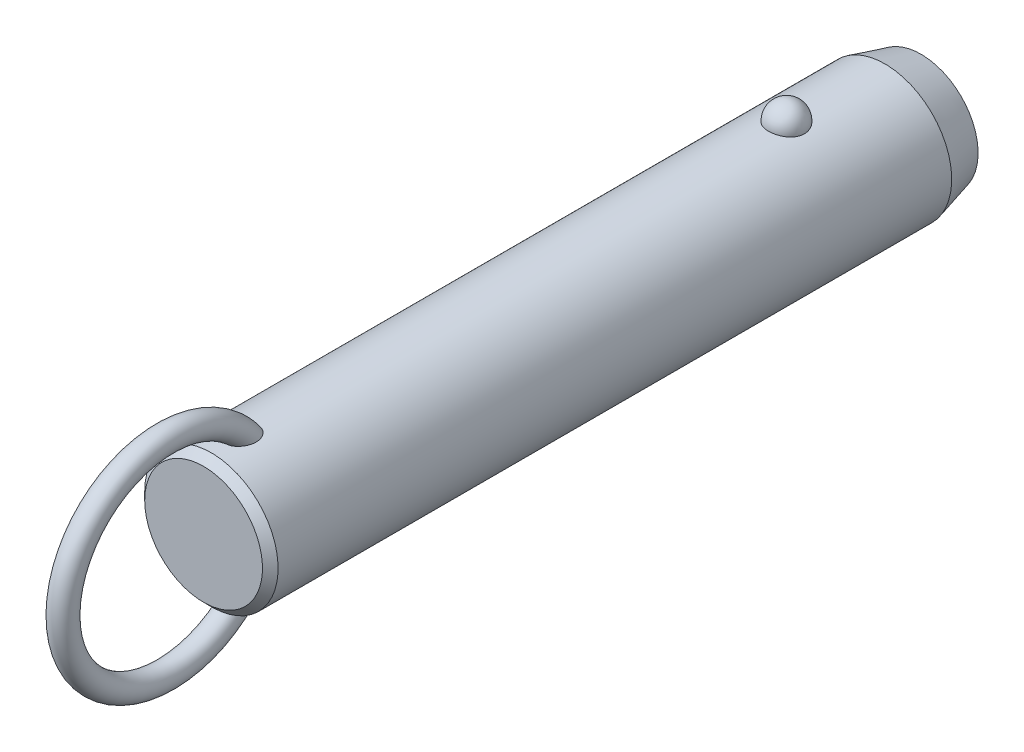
ISO-10303-21;
HEADER;
FILE_DESCRIPTION(('STEP AP214'),'2;1');
FILE_NAME('part.step','',(''),(''),'','','');
FILE_SCHEMA(('AUTOMOTIVE_DESIGN { 1 0 10303 214 1 1 1 1 }'));
ENDSEC;
DATA;
#1=APPLICATION_CONTEXT('core data for automotive mechanical design processes');
#2=APPLICATION_PROTOCOL_DEFINITION('international standard','automotive_design',2000,#1);
#3=PRODUCT_CONTEXT('',#1,'mechanical');
#4=PRODUCT('Part','Part','',(#3));
#5=PRODUCT_RELATED_PRODUCT_CATEGORY('part','',(#4));
#6=PRODUCT_DEFINITION_FORMATION('','',#4);
#7=PRODUCT_DEFINITION_CONTEXT('part definition',#1,'design');
#8=PRODUCT_DEFINITION('design','',#6,#7);
#9=PRODUCT_DEFINITION_SHAPE('','',#8);
#10=(LENGTH_UNIT() NAMED_UNIT(*) SI_UNIT(.MILLI.,.METRE.));
#11=(NAMED_UNIT(*) PLANE_ANGLE_UNIT() SI_UNIT($,.RADIAN.));
#12=(NAMED_UNIT(*) SI_UNIT($,.STERADIAN.) SOLID_ANGLE_UNIT());
#13=UNCERTAINTY_MEASURE_WITH_UNIT(LENGTH_MEASURE(1.E-05),#10,'distance_accuracy_value','');
#14=(GEOMETRIC_REPRESENTATION_CONTEXT(3) GLOBAL_UNCERTAINTY_ASSIGNED_CONTEXT((#13)) GLOBAL_UNIT_ASSIGNED_CONTEXT((#10,
#11,#12)) REPRESENTATION_CONTEXT('',''));
#15=CARTESIAN_POINT('',(0.,0.,0.));
#16=DIRECTION('',(0.,0.,1.));
#17=DIRECTION('',(1.,0.,0.));
#18=AXIS2_PLACEMENT_3D('',#15,#16,#17);
#19=CARTESIAN_POINT('',(0.,0.,81.3));
#20=DIRECTION('',(0.,0.,-1.));
#21=DIRECTION('',(-1.,0.,0.));
#22=AXIS2_PLACEMENT_3D('',#19,#20,#21);
#23=CYLINDRICAL_SURFACE('',#22,11.1);
#24=CARTESIAN_POINT('',(2.9724815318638,10.6945945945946,-3.));
#25=CARTESIAN_POINT('',(2.97247830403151,10.6945972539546,-2.83225059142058));
#26=CARTESIAN_POINT('',(2.95876598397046,10.6984356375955,-2.66445972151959));
#27=CARTESIAN_POINT('',(2.90424529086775,10.7133624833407,-2.33362381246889));
#28=CARTESIAN_POINT('',(2.8634252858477,10.7244540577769,-2.1705808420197));
#29=CARTESIAN_POINT('',(2.75573657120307,10.7526272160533,-1.85396767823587));
#30=CARTESIAN_POINT('',(2.68887937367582,10.7697061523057,-1.70039333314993));
#31=CARTESIAN_POINT('',(2.53079696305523,10.8079438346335,-1.40691598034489));
#32=CARTESIAN_POINT('',(2.43957264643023,10.8291024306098,-1.2670124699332));
#33=CARTESIAN_POINT('',(2.23458150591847,10.8732541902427,-1.00409565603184));
#34=CARTESIAN_POINT('',(2.12071295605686,10.8962553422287,-0.881162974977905));
#35=CARTESIAN_POINT('',(1.87365402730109,10.9414421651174,-0.656352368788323));
#36=CARTESIAN_POINT('',(1.74046358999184,10.9636278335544,-0.554474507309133));
#37=CARTESIAN_POINT('',(1.45872188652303,11.0046495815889,-0.374872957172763));
#38=CARTESIAN_POINT('',(1.31021276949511,11.0234944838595,-0.297085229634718));
#39=CARTESIAN_POINT('',(1.00170030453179,11.0557957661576,-0.167529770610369));
#40=CARTESIAN_POINT('',(0.841698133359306,11.0692526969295,-0.115759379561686));
#41=CARTESIAN_POINT('',(0.517607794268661,11.0890932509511,-0.0403925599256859));
#42=CARTESIAN_POINT('',(0.353633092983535,11.0955916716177,-0.0163383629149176));
#43=CARTESIAN_POINT('',(0.0238420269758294,11.1011989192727,0.0044517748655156));
#44=CARTESIAN_POINT('',(-0.141974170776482,11.1003084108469,0.00119017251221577));
#45=CARTESIAN_POINT('',(-0.468405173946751,11.0912990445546,-0.0323233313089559));
#46=CARTESIAN_POINT('',(-0.629059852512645,11.0832767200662,-0.0622147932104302));
#47=CARTESIAN_POINT('',(-0.942937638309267,11.0609962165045,-0.147645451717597));
#48=CARTESIAN_POINT('',(-1.09616062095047,11.0467379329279,-0.203185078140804));
#49=CARTESIAN_POINT('',(-1.39181061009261,11.0134071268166,-0.3387529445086));
#50=CARTESIAN_POINT('',(-1.53417383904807,10.9943086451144,-0.418913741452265));
#51=CARTESIAN_POINT('',(-1.80342160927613,10.9533667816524,-0.60144882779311));
#52=CARTESIAN_POINT('',(-1.9303046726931,10.9315231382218,-0.703825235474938));
#53=CARTESIAN_POINT('',(-2.16747598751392,10.887005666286,-0.930091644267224));
#54=CARTESIAN_POINT('',(-2.27742774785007,10.8643239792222,-1.05433291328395));
#55=CARTESIAN_POINT('',(-2.47517316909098,10.8209886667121,-1.31966633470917));
#56=CARTESIAN_POINT('',(-2.56296538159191,10.8003351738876,-1.46075958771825));
#57=CARTESIAN_POINT('',(-2.71500300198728,10.7631304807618,-1.75753646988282));
#58=CARTESIAN_POINT('',(-2.77898901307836,10.7466250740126,-1.91335887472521));
#59=CARTESIAN_POINT('',(-2.88046189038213,10.7198747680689,-2.2339152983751));
#60=CARTESIAN_POINT('',(-2.91794947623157,10.709629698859,-2.39864907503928));
#61=CARTESIAN_POINT('',(-2.96537819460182,10.6965949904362,-2.73165170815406));
#62=CARTESIAN_POINT('',(-2.97542891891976,10.693775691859,-2.89990378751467));
#63=CARTESIAN_POINT('',(-2.96804271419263,10.6958279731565,-3.235752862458));
#64=CARTESIAN_POINT('',(-2.95060646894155,10.7006993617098,-3.40334987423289));
#65=CARTESIAN_POINT('',(-2.88883358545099,10.71753912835,-3.73233906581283));
#66=CARTESIAN_POINT('',(-2.84462026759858,10.7294749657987,-3.89375610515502));
#67=CARTESIAN_POINT('',(-2.73050447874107,10.7590797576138,-4.20667949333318));
#68=CARTESIAN_POINT('',(-2.66060103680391,10.7767489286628,-4.35818546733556));
#69=CARTESIAN_POINT('',(-2.49642559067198,10.8159599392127,-4.6478542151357));
#70=CARTESIAN_POINT('',(-2.40203047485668,10.8375211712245,-4.78594458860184));
#71=CARTESIAN_POINT('',(-2.19143488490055,10.8820570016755,-5.0441038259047));
#72=CARTESIAN_POINT('',(-2.07523364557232,10.9050316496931,-5.16417205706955));
#73=CARTESIAN_POINT('',(-1.82361254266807,10.9499219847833,-5.38334833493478));
#74=CARTESIAN_POINT('',(-1.68812945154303,10.9718338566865,-5.48238464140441));
#75=CARTESIAN_POINT('',(-1.40191298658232,11.0120611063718,-5.65618873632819));
#76=CARTESIAN_POINT('',(-1.25118062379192,11.0303767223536,-5.73095813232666));
#77=CARTESIAN_POINT('',(-0.940570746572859,11.0611653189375,-5.85334725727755));
#78=CARTESIAN_POINT('',(-0.780821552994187,11.0737044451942,-5.90127578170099));
#79=CARTESIAN_POINT('',(-0.455204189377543,11.0918598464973,-5.96992976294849));
#80=CARTESIAN_POINT('',(-0.289336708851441,11.0974768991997,-5.99065827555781));
#81=CARTESIAN_POINT('',(0.0406846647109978,11.1011307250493,-6.00418773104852));
#82=CARTESIAN_POINT('',(0.204817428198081,11.099299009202,-5.99747318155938));
#83=CARTESIAN_POINT('',(0.5295530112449,11.088551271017,-5.9574031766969));
#84=CARTESIAN_POINT('',(0.69015594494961,11.0796354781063,-5.92404858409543));
#85=CARTESIAN_POINT('',(1.0027760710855,11.0557204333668,-5.83180084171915));
#86=CARTESIAN_POINT('',(1.15482001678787,11.0407414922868,-5.77299291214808));
#87=CARTESIAN_POINT('',(1.44678373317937,11.0062913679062,-5.63147366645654));
#88=CARTESIAN_POINT('',(1.58670279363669,10.9868199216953,-5.54876095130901));
#89=CARTESIAN_POINT('',(1.8527023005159,10.9451315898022,-5.36027644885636));
#90=CARTESIAN_POINT('',(1.97855158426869,10.9228788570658,-5.25418644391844));
#91=CARTESIAN_POINT('',(2.21080872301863,10.8782509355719,-5.02251354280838));
#92=CARTESIAN_POINT('',(2.31721312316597,10.8558757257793,-4.89692718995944));
#93=CARTESIAN_POINT('',(2.5094551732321,10.8130715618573,-4.62745408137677));
#94=CARTESIAN_POINT('',(2.59493284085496,10.7926798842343,-4.48330448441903));
#95=CARTESIAN_POINT('',(2.740862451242,10.7565495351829,-4.18236358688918));
#96=CARTESIAN_POINT('',(2.80132490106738,10.7408089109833,-4.02557762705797));
#97=CARTESIAN_POINT('',(2.88959070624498,10.7173718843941,-3.72475308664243));
#98=CARTESIAN_POINT('',(2.92062102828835,10.7088950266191,-3.58171216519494));
#99=CARTESIAN_POINT('',(2.96206765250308,10.6975052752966,-3.29245795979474));
#100=CARTESIAN_POINT('',(2.97248434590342,10.6945922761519,-3.14624473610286));
#101=CARTESIAN_POINT('',(2.9724815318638,10.6945945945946,-3.));
#102=B_SPLINE_CURVE_WITH_KNOTS('',3,(#24,#25,#26,#27,#28,#29,#30,#31,#32,#33,#34,#35,#36,#37,
#38,#39,#40,#41,#42,#43,#44,#45,#46,#47,#48,#49,#50,#51,#52,#53,#54,#55,#56,#57,#58,#59,#60,#61,
#62,#63,#64,#65,#66,#67,#68,#69,#70,#71,#72,#73,#74,#75,#76,#77,#78,#79,#80,#81,#82,#83,#84,#85,
#86,#87,#88,#89,#90,#91,#92,#93,#94,#95,#96,#97,#98,#99,#100,#101),.UNSPECIFIED.,.T.,.F.,(4,2,2,
2,2,2,2,2,2,2,2,2,2,2,2,2,2,2,2,2,2,2,2,2,2,2,2,2,2,2,2,2,2,2,2,2,2,2,4),(0.,0.502722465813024,
1.00566079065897,1.5083769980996,2.01107471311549,2.51608392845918,3.02109467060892,
3.52475118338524,4.02835620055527,4.523518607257,5.0186364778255,5.50715297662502,
5.9956776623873,6.48688002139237,6.97812923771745,7.47814366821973,7.9781907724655,
8.48353712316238,8.9888697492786,9.49218093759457,9.99547960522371,10.4964777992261,
10.997494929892,11.5010810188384,12.0046847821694,12.5099796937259,13.0152411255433,
13.5145635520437,14.0138298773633,14.5043200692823,14.9947943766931,15.4836390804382,
15.9725123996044,16.4685040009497,16.9645836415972,17.4686765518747,17.972557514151,
18.410841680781,18.849117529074),.UNSPECIFIED.);
#103=CARTESIAN_POINT('',(2.9724815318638,10.6945945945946,-3.));
#104=VERTEX_POINT('',#103);
#105=EDGE_CURVE('E41',#104,#104,#102,.T.);
#106=ORIENTED_EDGE('',*,*,#105,.T.);
#107=EDGE_LOOP('',(#106));
#108=FACE_BOUND('',#107,.T.);
#109=CARTESIAN_POINT('',(0.,0.,92.7));
#110=DIRECTION('',(0.,0.,1.));
#111=DIRECTION('',(1.,0.,0.));
#112=AXIS2_PLACEMENT_3D('',#109,#110,#111);
#113=CIRCLE('',#112,11.1);
#114=CARTESIAN_POINT('',(-11.1,0.,92.7));
#115=VERTEX_POINT('',#114);
#116=EDGE_CURVE('E10',#115,#115,#113,.F.);
#117=ORIENTED_EDGE('',*,*,#116,.T.);
#118=EDGE_LOOP('',(#117));
#119=FACE_BOUND('',#118,.T.);
#120=CARTESIAN_POINT('',(-0.564520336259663,-11.0856356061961,84.9578154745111));
#121=CARTESIAN_POINT('',(-0.667202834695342,-11.0804062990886,84.9912839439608));
#122=CARTESIAN_POINT('',(-0.766875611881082,-11.0738877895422,85.0338357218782));
#123=CARTESIAN_POINT('',(-0.957284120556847,-11.0590576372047,85.1354190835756));
#124=CARTESIAN_POINT('',(-1.04801616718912,-11.0507452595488,85.1944574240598));
#125=CARTESIAN_POINT('',(-1.21800952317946,-11.0333016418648,85.3265293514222));
#126=CARTESIAN_POINT('',(-1.29730805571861,-11.0241732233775,85.3995156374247));
#127=CARTESIAN_POINT('',(-1.44337665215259,-11.0060026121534,85.5570374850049));
#128=CARTESIAN_POINT('',(-1.51014622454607,-10.9969604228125,85.6415734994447));
#129=CARTESIAN_POINT('',(-1.63454620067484,-10.9791841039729,85.8255213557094));
#130=CARTESIAN_POINT('',(-1.69127003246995,-10.9705107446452,85.9255493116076));
#131=CARTESIAN_POINT('',(-1.78980785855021,-10.9548648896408,86.1327902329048));
#132=CARTESIAN_POINT('',(-1.83161214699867,-10.9478935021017,86.2400078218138));
#133=CARTESIAN_POINT('',(-1.91557028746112,-10.9335803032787,86.5054080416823));
#134=CARTESIAN_POINT('',(-1.95040620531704,-10.9273269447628,86.6659806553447));
#135=CARTESIAN_POINT('',(-1.99388326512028,-10.9194709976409,86.9906977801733));
#136=CARTESIAN_POINT('',(-2.00248051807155,-10.9178762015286,87.1548478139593));
#137=CARTESIAN_POINT('',(-1.99551615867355,-10.9191578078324,87.5246504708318));
#138=CARTESIAN_POINT('',(-1.9732206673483,-10.9232807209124,87.7301911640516));
#139=CARTESIAN_POINT('',(-1.91529761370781,-10.9335244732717,88.0335954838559));
#140=CARTESIAN_POINT('',(-1.8918457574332,-10.9376266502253,88.1340883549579));
#141=CARTESIAN_POINT('',(-1.83700674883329,-10.9469720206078,88.332855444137));
#142=CARTESIAN_POINT('',(-1.80562070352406,-10.9522150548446,88.4311299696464));
#143=CARTESIAN_POINT('',(-1.73463055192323,-10.9636837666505,88.6259148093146));
#144=CARTESIAN_POINT('',(-1.69493416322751,-10.9699202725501,88.7223907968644));
#145=CARTESIAN_POINT('',(-1.6074514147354,-10.9830806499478,88.9116262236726));
#146=CARTESIAN_POINT('',(-1.55966150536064,-10.9900048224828,89.0043840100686));
#147=CARTESIAN_POINT('',(-1.45591812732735,-11.0042280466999,89.1846907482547));
#148=CARTESIAN_POINT('',(-1.40000013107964,-11.0115253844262,89.2722601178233));
#149=CARTESIAN_POINT('',(-1.27937470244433,-11.0261911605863,89.4410298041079));
#150=CARTESIAN_POINT('',(-1.21467835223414,-11.0335594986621,89.5222379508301));
#151=CARTESIAN_POINT('',(-1.08218150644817,-11.0473027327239,89.6690010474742));
#152=CARTESIAN_POINT('',(-1.01522633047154,-11.0537063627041,89.735309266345));
#153=CARTESIAN_POINT('',(-0.872952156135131,-11.065850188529,89.8583780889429));
#154=CARTESIAN_POINT('',(-0.797642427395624,-11.0715911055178,89.9151491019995));
#155=CARTESIAN_POINT('',(-0.651396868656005,-11.081071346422,90.0075155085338));
#156=CARTESIAN_POINT('',(-0.581712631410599,-11.0849841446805,90.0450491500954));
#157=CARTESIAN_POINT('',(-0.437066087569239,-11.0916271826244,90.1082594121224));
#158=CARTESIAN_POINT('',(-0.362109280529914,-11.0943586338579,90.1339481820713));
#159=CARTESIAN_POINT('',(-0.207828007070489,-11.0983242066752,90.171117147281));
#160=CARTESIAN_POINT('',(-0.128467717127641,-11.0995432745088,90.1824545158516));
#161=CARTESIAN_POINT('',(0.0309101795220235,-11.1002423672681,90.1889658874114));
#162=CARTESIAN_POINT('',(0.110927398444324,-11.0997233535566,90.1841488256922));
#163=CARTESIAN_POINT('',(0.256406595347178,-11.097240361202,90.1609599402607));
#164=CARTESIAN_POINT('',(0.32223577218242,-11.0955074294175,90.1447543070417));
#165=CARTESIAN_POINT('',(0.450635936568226,-11.0910350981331,90.1026008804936));
#166=CARTESIAN_POINT('',(0.513205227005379,-11.0882951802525,90.0766480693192));
#167=CARTESIAN_POINT('',(0.662626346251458,-11.0805620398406,90.0026073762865));
#168=CARTESIAN_POINT('',(0.747127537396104,-11.0751144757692,89.9498452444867));
#169=CARTESIAN_POINT('',(0.906756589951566,-11.0631932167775,89.8317206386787));
#170=CARTESIAN_POINT('',(0.981859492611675,-11.0567168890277,89.7663257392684));
#171=CARTESIAN_POINT('',(1.10712207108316,-11.0447856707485,89.6422633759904));
#172=CARTESIAN_POINT('',(1.15909566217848,-11.0394280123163,89.5853831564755));
#173=CARTESIAN_POINT('',(1.25791923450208,-11.0286040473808,89.4673271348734));
#174=CARTESIAN_POINT('',(1.30476642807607,-11.0231376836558,89.4061490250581));
#175=CARTESIAN_POINT('',(1.43818612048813,-11.0068027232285,89.217305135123));
#176=CARTESIAN_POINT('',(1.51751767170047,-10.9960104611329,89.0844531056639));
#177=CARTESIAN_POINT('',(1.63597546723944,-10.9788847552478,88.8531371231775));
#178=CARTESIAN_POINT('',(1.67988876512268,-10.9722190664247,88.7570530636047));
#179=CARTESIAN_POINT('',(1.75953241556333,-10.9597298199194,88.5614311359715));
#180=CARTESIAN_POINT('',(1.79525967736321,-10.9539065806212,88.4618919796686));
#181=CARTESIAN_POINT('',(1.85844731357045,-10.9433632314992,88.2602111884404));
#182=CARTESIAN_POINT('',(1.88591073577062,-10.9386427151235,88.1580705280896));
#183=CARTESIAN_POINT('',(1.93234324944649,-10.9305350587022,87.9518191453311));
#184=CARTESIAN_POINT('',(1.95131065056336,-10.9271481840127,87.8477080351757));
#185=CARTESIAN_POINT('',(1.99040203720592,-10.9201183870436,87.5654588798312));
#186=CARTESIAN_POINT('',(2.00221217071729,-10.9179256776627,87.3860370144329));
#187=CARTESIAN_POINT('',(1.99711676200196,-10.9188636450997,87.0277133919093));
#188=CARTESIAN_POINT('',(1.98026150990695,-10.9219849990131,86.848811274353));
#189=CARTESIAN_POINT('',(1.92151657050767,-10.9324473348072,86.5364514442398));
#190=CARTESIAN_POINT('',(1.88605081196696,-10.9386915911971,86.4017594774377));
#191=CARTESIAN_POINT('',(1.7939302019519,-10.9541780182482,86.1399669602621));
#192=CARTESIAN_POINT('',(1.73729868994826,-10.9634168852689,86.0128582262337));
#193=CARTESIAN_POINT('',(1.612370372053,-10.9824218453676,85.7894184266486));
#194=CARTESIAN_POINT('',(1.54715374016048,-10.9918945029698,85.6913455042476));
#195=CARTESIAN_POINT('',(1.40127026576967,-11.0114415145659,85.5074341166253));
#196=CARTESIAN_POINT('',(1.32060742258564,-11.0215157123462,85.4215924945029));
#197=CARTESIAN_POINT('',(1.14474787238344,-11.041168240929,85.2651630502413));
#198=CARTESIAN_POINT('',(1.04947805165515,-11.0507437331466,85.1946565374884));
#199=CARTESIAN_POINT('',(0.847278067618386,-11.0680789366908,85.072640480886));
#200=CARTESIAN_POINT('',(0.74035174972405,-11.0758392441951,85.0211246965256));
#201=CARTESIAN_POINT('',(0.52928931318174,-11.0878275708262,84.9434852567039));
#202=CARTESIAN_POINT('',(0.425895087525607,-11.0923259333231,84.915377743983));
#203=CARTESIAN_POINT('',(0.215723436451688,-11.0984001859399,84.8777038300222));
#204=CARTESIAN_POINT('',(0.108947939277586,-11.0999777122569,84.8681270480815));
#205=CARTESIAN_POINT('',(-0.0938962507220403,-11.1000196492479,84.8678773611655));
#206=CARTESIAN_POINT('',(-0.189967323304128,-11.0987797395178,84.8754089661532));
#207=CARTESIAN_POINT('',(-0.379657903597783,-11.0939111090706,84.9055079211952));
#208=CARTESIAN_POINT('',(-0.473277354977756,-11.0902823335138,84.9280756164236));
#209=CARTESIAN_POINT('',(-0.564520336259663,-11.0856356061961,84.9578154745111));
#210=B_SPLINE_CURVE_WITH_KNOTS('',3,(#120,#121,#122,#123,#124,#125,#126,#127,#128,#129,#130,
#131,#132,#133,#134,#135,#136,#137,#138,#139,#140,#141,#142,#143,#144,#145,#146,#147,#148,#149,
#150,#151,#152,#153,#154,#155,#156,#157,#158,#159,#160,#161,#162,#163,#164,#165,#166,#167,#168,
#169,#170,#171,#172,#173,#174,#175,#176,#177,#178,#179,#180,#181,#182,#183,#184,#185,#186,#187,
#188,#189,#190,#191,#192,#193,#194,#195,#196,#197,#198,#199,#200,#201,#202,#203,#204,#205,#206,
#207,#208,#209),.UNSPECIFIED.,.T.,.F.,(4,2,2,2,2,2,2,2,2,2,2,2,2,2,2,2,2,2,2,2,2,2,2,2,2,2,2,2,
2,2,2,2,2,2,2,2,2,2,2,2,2,2,2,2,4),(0.,0.323999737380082,0.648132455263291,0.971184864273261,
1.29424994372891,1.63886237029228,1.98369857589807,2.47426059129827,2.96564271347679,
3.58257396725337,3.89215258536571,4.20168803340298,4.51486273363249,4.82817514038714,
5.14015911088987,5.45175282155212,5.73442856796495,6.01679375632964,6.25364580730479,
6.49025437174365,6.7291996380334,6.96801276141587,7.17061258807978,7.37331685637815,
7.67094989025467,7.96935728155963,8.20075067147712,8.43226927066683,8.89581623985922,
9.21306533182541,9.53043400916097,9.84768549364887,10.1650000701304,10.70229304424,
11.2386443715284,11.6553390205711,12.0715755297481,12.4245637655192,12.7774607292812,
13.1321855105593,13.4867936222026,13.8068771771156,14.1267813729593,14.4146787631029,
14.7025827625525),.UNSPECIFIED.);
#211=CARTESIAN_POINT('',(-0.564520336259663,-11.0856356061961,84.9578154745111));
#212=VERTEX_POINT('',#211);
#213=EDGE_CURVE('E60',#212,#212,#210,.T.);
#214=ORIENTED_EDGE('',*,*,#213,.T.);
#215=EDGE_LOOP('',(#214));
#216=FACE_BOUND('',#215,.T.);
#217=CARTESIAN_POINT('',(-0.564520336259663,11.0856356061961,84.9578154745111));
#218=CARTESIAN_POINT('',(-0.468542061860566,11.0905203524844,84.9265456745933));
#219=CARTESIAN_POINT('',(-0.36979381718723,11.0942886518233,84.9031576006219));
#220=CARTESIAN_POINT('',(-0.169555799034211,11.0991586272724,84.8730858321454));
#221=CARTESIAN_POINT('',(-0.0680604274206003,11.1002543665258,84.8664393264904));
#222=CARTESIAN_POINT('',(0.134549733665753,11.099646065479,84.8701579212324));
#223=CARTESIAN_POINT('',(0.235664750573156,11.0979441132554,84.8805103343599));
#224=CARTESIAN_POINT('',(0.43463240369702,11.0919342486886,84.9178318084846));
#225=CARTESIAN_POINT('',(0.53248665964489,11.0876276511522,84.9447924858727));
#226=CARTESIAN_POINT('',(0.72244585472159,11.0768742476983,85.0144096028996));
#227=CARTESIAN_POINT('',(0.814543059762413,11.0704246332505,85.0570866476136));
#228=CARTESIAN_POINT('',(0.990565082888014,11.0560659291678,85.1566487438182));
#229=CARTESIAN_POINT('',(1.07448844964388,11.048156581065,85.2135363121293));
#230=CARTESIAN_POINT('',(1.23562672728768,11.0313221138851,85.3422106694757));
#231=CARTESIAN_POINT('',(1.31242684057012,11.0223686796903,85.4145117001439));
#232=CARTESIAN_POINT('',(1.45398030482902,11.0045918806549,85.5700425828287));
#233=CARTESIAN_POINT('',(1.51873073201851,10.9957685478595,85.6532750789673));
#234=CARTESIAN_POINT('',(1.64107232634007,10.9782087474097,85.8363842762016));
#235=CARTESIAN_POINT('',(1.69743176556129,10.9695572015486,85.9370893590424));
#236=CARTESIAN_POINT('',(1.79515063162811,10.9539887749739,86.1456264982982));
#237=CARTESIAN_POINT('',(1.83649966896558,10.9470730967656,86.2534634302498));
#238=CARTESIAN_POINT('',(1.91931148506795,10.9329211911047,86.5203995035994));
#239=CARTESIAN_POINT('',(1.9534010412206,10.9267904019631,86.6818612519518));
#240=CARTESIAN_POINT('',(1.99526195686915,10.9192174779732,87.0082163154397));
#241=CARTESIAN_POINT('',(2.00298989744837,10.9177830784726,87.1731148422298));
#242=CARTESIAN_POINT('',(1.99396251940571,10.9194420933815,87.5441006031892));
#243=CARTESIAN_POINT('',(1.97050829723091,10.923774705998,87.7500387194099));
#244=CARTESIAN_POINT('',(1.91079643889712,10.9343131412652,88.0539019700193));
#245=CARTESIAN_POINT('',(1.88673702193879,10.9385106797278,88.1545296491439));
#246=CARTESIAN_POINT('',(1.83065508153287,10.9480376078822,88.3535107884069));
#247=CARTESIAN_POINT('',(1.79863369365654,10.9533668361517,88.451864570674));
#248=CARTESIAN_POINT('',(1.72633365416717,10.9649954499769,88.646720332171));
#249=CARTESIAN_POINT('',(1.68596409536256,10.9713053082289,88.7431879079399));
#250=CARTESIAN_POINT('',(1.5970799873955,10.9845964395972,88.9323233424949));
#251=CARTESIAN_POINT('',(1.54856169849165,10.9915780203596,89.0249894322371));
#252=CARTESIAN_POINT('',(1.44330168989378,11.0058935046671,89.2049752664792));
#253=CARTESIAN_POINT('',(1.38659749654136,11.0132257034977,89.292316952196));
#254=CARTESIAN_POINT('',(1.26431158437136,11.0279330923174,89.4604563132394));
#255=CARTESIAN_POINT('',(1.19874160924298,11.0353082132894,89.5412624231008));
#256=CARTESIAN_POINT('',(1.06542088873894,11.0489310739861,89.6859856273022));
#257=CARTESIAN_POINT('',(0.998640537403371,11.0552153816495,89.750784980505));
#258=CARTESIAN_POINT('',(0.856896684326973,11.0671032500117,89.870846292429));
#259=CARTESIAN_POINT('',(0.781942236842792,11.0727075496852,89.9261186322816));
#260=CARTESIAN_POINT('',(0.636276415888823,11.081949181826,90.0159721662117));
#261=CARTESIAN_POINT('',(0.5667558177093,11.0857572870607,90.0524410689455));
#262=CARTESIAN_POINT('',(0.422602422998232,11.0921860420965,90.1135333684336));
#263=CARTESIAN_POINT('',(0.347974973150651,11.0948079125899,90.1381689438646));
#264=CARTESIAN_POINT('',(0.194593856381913,11.0985608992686,90.1733233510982));
#265=CARTESIAN_POINT('',(0.115807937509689,11.0996777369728,90.1837069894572));
#266=CARTESIAN_POINT('',(-0.0422499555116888,11.1002003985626,90.1885747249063));
#267=CARTESIAN_POINT('',(-0.121521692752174,11.09960699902,90.183066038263));
#268=CARTESIAN_POINT('',(-0.266046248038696,11.0970123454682,90.1588271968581));
#269=CARTESIAN_POINT('',(-0.331661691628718,11.0952283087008,90.1421356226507));
#270=CARTESIAN_POINT('',(-0.459588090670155,11.0906663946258,90.0991117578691));
#271=CARTESIAN_POINT('',(-0.521897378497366,11.0878880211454,90.072774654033));
#272=CARTESIAN_POINT('',(-0.671446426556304,11.0800342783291,89.9975130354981));
#273=CARTESIAN_POINT('',(-0.756250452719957,11.0744969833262,89.9438182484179));
#274=CARTESIAN_POINT('',(-0.916349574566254,11.0624045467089,89.8238029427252));
#275=CARTESIAN_POINT('',(-0.991618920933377,11.0558467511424,89.7574493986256));
#276=CARTESIAN_POINT('',(-1.11713140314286,11.0437783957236,89.6316335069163));
#277=CARTESIAN_POINT('',(-1.16920539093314,11.0383619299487,89.5739524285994));
#278=CARTESIAN_POINT('',(-1.26817476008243,11.02743010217,89.4542809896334));
#279=CARTESIAN_POINT('',(-1.31506731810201,11.0219146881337,89.3922883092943));
#280=CARTESIAN_POINT('',(-1.40399813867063,11.0109399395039,89.2647843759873));
#281=CARTESIAN_POINT('',(-1.44602864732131,11.0054807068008,89.1992677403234));
#282=CARTESIAN_POINT('',(-1.52538779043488,10.9947621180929,89.0654223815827));
#283=CARTESIAN_POINT('',(-1.56271516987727,10.9895028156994,88.9970929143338));
#284=CARTESIAN_POINT('',(-1.64537943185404,10.9774790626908,88.8332101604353));
#285=CARTESIAN_POINT('',(-1.68879497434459,10.9708503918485,88.7366735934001));
#286=CARTESIAN_POINT('',(-1.76740738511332,10.9584602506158,88.5402369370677));
#287=CARTESIAN_POINT('',(-1.80260120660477,10.95269910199,88.4403356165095));
#288=CARTESIAN_POINT('',(-1.86468657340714,10.9423003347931,88.2379663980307));
#289=CARTESIAN_POINT('',(-1.8915816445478,10.9376622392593,88.1354996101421));
#290=CARTESIAN_POINT('',(-1.93682458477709,10.9297405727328,87.9286429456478));
#291=CARTESIAN_POINT('',(-1.9551708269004,10.9264572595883,87.8242527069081));
#292=CARTESIAN_POINT('',(-1.99232562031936,10.9197647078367,87.5426287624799));
#293=CARTESIAN_POINT('',(-2.00294603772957,10.9177914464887,87.3641857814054));
#294=CARTESIAN_POINT('',(-1.99566675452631,10.9191290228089,87.0079962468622));
#295=CARTESIAN_POINT('',(-1.97781651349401,10.9224306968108,86.8302490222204));
#296=CARTESIAN_POINT('',(-1.91747214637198,10.9331592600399,86.5197921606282));
#297=CARTESIAN_POINT('',(-1.88131022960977,10.9395108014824,86.385825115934));
#298=CARTESIAN_POINT('',(-1.78790380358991,10.9551659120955,86.1255975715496));
#299=CARTESIAN_POINT('',(-1.7306830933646,10.9644661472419,85.9993285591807));
#300=CARTESIAN_POINT('',(-1.60475573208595,10.9835398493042,85.7774156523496));
#301=CARTESIAN_POINT('',(-1.53908879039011,10.9930297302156,85.6800265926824));
#302=CARTESIAN_POINT('',(-1.39238608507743,11.0125708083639,85.4975250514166));
#303=CARTESIAN_POINT('',(-1.31135150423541,11.0226219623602,85.4124116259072));
#304=CARTESIAN_POINT('',(-1.14382035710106,11.0411991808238,85.2652994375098));
#305=CARTESIAN_POINT('',(-1.05858500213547,11.0497792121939,85.2018693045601));
#306=CARTESIAN_POINT('',(-0.878723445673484,11.0655285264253,85.0902505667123));
#307=CARTESIAN_POINT('',(-0.784123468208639,11.0727015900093,85.0420208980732));
#308=CARTESIAN_POINT('',(-0.646163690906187,11.0812501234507,84.986023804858));
#309=CARTESIAN_POINT('',(-0.605595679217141,11.0835451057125,84.9711978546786));
#310=CARTESIAN_POINT('',(-0.564520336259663,11.0856356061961,84.9578154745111));
#311=B_SPLINE_CURVE_WITH_KNOTS('',3,(#217,#218,#219,#220,#221,#222,#223,#224,#225,#226,#227,
#228,#229,#230,#231,#232,#233,#234,#235,#236,#237,#238,#239,#240,#241,#242,#243,#244,#245,#246,
#247,#248,#249,#250,#251,#252,#253,#254,#255,#256,#257,#258,#259,#260,#261,#262,#263,#264,#265,
#266,#267,#268,#269,#270,#271,#272,#273,#274,#275,#276,#277,#278,#279,#280,#281,#282,#283,#284,
#285,#286,#287,#288,#289,#290,#291,#292,#293,#294,#295,#296,#297,#298,#299,#300,#301,#302,#303,
#304,#305,#306,#307,#308,#309,#310),.UNSPECIFIED.,.T.,.F.,(4,2,2,2,2,2,2,2,2,2,2,2,2,2,2,2,2,2,
2,2,2,2,2,2,2,2,2,2,2,2,2,2,2,2,2,2,2,2,2,2,2,2,2,2,2,2,4),(0.,0.303061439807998,
0.606795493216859,0.910302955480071,1.21365733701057,1.51741085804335,1.82121821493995,
2.1374520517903,2.45376252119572,2.79958678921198,3.14564996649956,3.63832391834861,
4.13180893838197,4.75031912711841,5.06071926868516,5.37107516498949,5.68500772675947,
5.99908475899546,6.31176519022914,6.62403542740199,6.90315673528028,7.1819719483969,
7.41687778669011,7.65154134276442,7.88841587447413,8.12518286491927,8.3275284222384,
8.52997509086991,8.82986421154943,9.13054668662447,9.36393502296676,9.59744991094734,
9.83133221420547,10.0652767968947,10.383032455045,10.7009056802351,11.0186436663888,
11.3364420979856,11.8705925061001,12.4038159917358,12.8189662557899,13.2336487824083,
13.5857049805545,13.9377340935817,14.2561354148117,14.5736690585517,14.7033687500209),.UNSPECIFIED.);
#312=CARTESIAN_POINT('',(-0.564520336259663,11.0856356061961,84.9578154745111));
#313=VERTEX_POINT('',#312);
#314=EDGE_CURVE('E68',#313,#313,#311,.T.);
#315=ORIENTED_EDGE('',*,*,#314,.T.);
#316=EDGE_LOOP('',(#315));
#317=FACE_BOUND('',#316,.T.);
#318=CARTESIAN_POINT('',(0.,0.,-19.3999999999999));
#319=DIRECTION('',(0.,0.,-1.));
#320=DIRECTION('',(-1.,0.,0.));
#321=AXIS2_PLACEMENT_3D('',#318,#319,#320);
#322=CIRCLE('',#321,11.1);
#323=CARTESIAN_POINT('',(-11.1,0.,-19.3999999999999));
#324=VERTEX_POINT('',#323);
#325=EDGE_CURVE('E57',#324,#324,#322,.F.);
#326=ORIENTED_EDGE('',*,*,#325,.T.);
#327=EDGE_LOOP('',(#326));
#328=FACE_BOUND('',#327,.T.);
#329=ADVANCED_FACE('F37',(#108,#119,#216,#317,#328),#23,.T.);
#330=CARTESIAN_POINT('',(0.,0.,-25.4));
#331=DIRECTION('',(0.,0.,-1.));
#332=DIRECTION('',(-1.,0.,0.));
#333=AXIS2_PLACEMENT_3D('',#330,#331,#332);
#334=PLANE('',#333);
#335=CARTESIAN_POINT('',(0.,0.,-25.4));
#336=DIRECTION('',(0.,0.,-1.));
#337=DIRECTION('',(-1.,0.,0.));
#338=AXIS2_PLACEMENT_3D('',#335,#336,#337);
#339=CIRCLE('',#338,9.49230484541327);
#340=CARTESIAN_POINT('',(-9.49230484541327,0.,-25.4));
#341=VERTEX_POINT('',#340);
#342=EDGE_CURVE('E67',#341,#341,#339,.T.);
#343=ORIENTED_EDGE('',*,*,#342,.T.);
#344=EDGE_LOOP('',(#343));
#345=FACE_BOUND('',#344,.T.);
#346=ADVANCED_FACE('F86',(#345),#334,.T.);
#347=CARTESIAN_POINT('',(0.,0.,-25.4));
#348=DIRECTION('',(0.,0.,1.));
#349=DIRECTION('',(1.,0.,0.));
#350=AXIS2_PLACEMENT_3D('',#347,#348,#349);
#351=CONICAL_SURFACE('',#350,9.49230484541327,0.261799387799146);
#352=ORIENTED_EDGE('',*,*,#325,.F.);
#353=EDGE_LOOP('',(#352));
#354=FACE_BOUND('',#353,.T.);
#355=ORIENTED_EDGE('',*,*,#342,.F.);
#356=EDGE_LOOP('',(#355));
#357=FACE_BOUND('',#356,.T.);
#358=ADVANCED_FACE('F84',(#354,#357),#351,.T.);
#359=CARTESIAN_POINT('',(0.,0.,94.));
#360=DIRECTION('',(0.,0.,1.));
#361=DIRECTION('',(1.,0.,0.));
#362=AXIS2_PLACEMENT_3D('',#359,#360,#361);
#363=PLANE('',#362);
#364=CARTESIAN_POINT('',(0.,0.,94.));
#365=DIRECTION('',(0.,0.,1.));
#366=DIRECTION('',(1.,0.,0.));
#367=AXIS2_PLACEMENT_3D('',#364,#365,#366);
#368=CIRCLE('',#367,9.8);
#369=CARTESIAN_POINT('',(-9.80000000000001,0.,94.));
#370=VERTEX_POINT('',#369);
#371=EDGE_CURVE('E50',#370,#370,#368,.T.);
#372=ORIENTED_EDGE('',*,*,#371,.T.);
#373=EDGE_LOOP('',(#372));
#374=FACE_BOUND('',#373,.T.);
#375=ADVANCED_FACE('F78',(#374),#363,.T.);
#376=CARTESIAN_POINT('',(0.,0.,100.35));
#377=DIRECTION('',(1.,0.,0.));
#378=DIRECTION('',(0.,0.,-1.));
#379=AXIS2_PLACEMENT_3D('',#376,#377,#378);
#380=TOROIDAL_SURFACE('',#379,17.05,2.);
#381=ORIENTED_EDGE('',*,*,#314,.F.);
#382=EDGE_LOOP('',(#381));
#383=FACE_BOUND('',#382,.T.);
#384=ORIENTED_EDGE('',*,*,#213,.F.);
#385=EDGE_LOOP('',(#384));
#386=FACE_BOUND('',#385,.T.);
#387=ADVANCED_FACE('F74',(#383,#386),#380,.T.);
#388=CARTESIAN_POINT('',(0.,0.,94.));
#389=DIRECTION('',(0.,0.,-1.));
#390=DIRECTION('',(-1.,0.,0.));
#391=AXIS2_PLACEMENT_3D('',#388,#389,#390);
#392=CONICAL_SURFACE('',#391,9.8,0.785398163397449);
#393=CARTESIAN_POINT('',(-11.1,0.,92.7));
#394=CARTESIAN_POINT('',(-11.0864583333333,0.,92.7135416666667));
#395=CARTESIAN_POINT('',(-11.0729166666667,0.,92.7270833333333));
#396=CARTESIAN_POINT('',(-11.0458333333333,0.,92.7541666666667));
#397=CARTESIAN_POINT('',(-11.0322916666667,0.,92.7677083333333));
#398=CARTESIAN_POINT('',(-11.0052083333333,0.,92.7947916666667));
#399=CARTESIAN_POINT('',(-10.9916666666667,0.,92.8083333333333));
#400=CARTESIAN_POINT('',(-10.9645833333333,0.,92.8354166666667));
#401=CARTESIAN_POINT('',(-10.9510416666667,0.,92.8489583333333));
#402=CARTESIAN_POINT('',(-10.9239583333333,0.,92.8760416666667));
#403=CARTESIAN_POINT('',(-10.9104166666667,0.,92.8895833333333));
#404=CARTESIAN_POINT('',(-10.8833333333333,0.,92.9166666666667));
#405=CARTESIAN_POINT('',(-10.8697916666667,0.,92.9302083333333));
#406=CARTESIAN_POINT('',(-10.8427083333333,0.,92.9572916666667));
#407=CARTESIAN_POINT('',(-10.8291666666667,0.,92.9708333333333));
#408=CARTESIAN_POINT('',(-10.8020833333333,0.,92.9979166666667));
#409=CARTESIAN_POINT('',(-10.7885416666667,0.,93.0114583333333));
#410=CARTESIAN_POINT('',(-10.7614583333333,0.,93.0385416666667));
#411=CARTESIAN_POINT('',(-10.7479166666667,0.,93.0520833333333));
#412=CARTESIAN_POINT('',(-10.7208333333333,0.,93.0791666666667));
#413=CARTESIAN_POINT('',(-10.7072916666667,0.,93.0927083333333));
#414=CARTESIAN_POINT('',(-10.6802083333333,0.,93.1197916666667));
#415=CARTESIAN_POINT('',(-10.6666666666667,0.,93.1333333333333));
#416=CARTESIAN_POINT('',(-10.6395833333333,0.,93.1604166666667));
#417=CARTESIAN_POINT('',(-10.6260416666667,0.,93.1739583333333));
#418=CARTESIAN_POINT('',(-10.5989583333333,0.,93.2010416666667));
#419=CARTESIAN_POINT('',(-10.5854166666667,0.,93.2145833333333));
#420=CARTESIAN_POINT('',(-10.5583333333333,0.,93.2416666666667));
#421=CARTESIAN_POINT('',(-10.5447916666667,0.,93.2552083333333));
#422=CARTESIAN_POINT('',(-10.5177083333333,0.,93.2822916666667));
#423=CARTESIAN_POINT('',(-10.5041666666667,0.,93.2958333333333));
#424=CARTESIAN_POINT('',(-10.4770833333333,0.,93.3229166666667));
#425=CARTESIAN_POINT('',(-10.4635416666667,0.,93.3364583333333));
#426=CARTESIAN_POINT('',(-10.4364583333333,0.,93.3635416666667));
#427=CARTESIAN_POINT('',(-10.4229166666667,0.,93.3770833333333));
#428=CARTESIAN_POINT('',(-10.3958333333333,0.,93.4041666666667));
#429=CARTESIAN_POINT('',(-10.3822916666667,0.,93.4177083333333));
#430=CARTESIAN_POINT('',(-10.3552083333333,0.,93.4447916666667));
#431=CARTESIAN_POINT('',(-10.3416666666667,0.,93.4583333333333));
#432=CARTESIAN_POINT('',(-10.3145833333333,0.,93.4854166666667));
#433=CARTESIAN_POINT('',(-10.3010416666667,0.,93.4989583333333));
#434=CARTESIAN_POINT('',(-10.2739583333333,0.,93.5260416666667));
#435=CARTESIAN_POINT('',(-10.2604166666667,0.,93.5395833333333));
#436=CARTESIAN_POINT('',(-10.2333333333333,0.,93.5666666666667));
#437=CARTESIAN_POINT('',(-10.2197916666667,0.,93.5802083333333));
#438=CARTESIAN_POINT('',(-10.1927083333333,0.,93.6072916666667));
#439=CARTESIAN_POINT('',(-10.1791666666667,0.,93.6208333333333));
#440=CARTESIAN_POINT('',(-10.1520833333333,0.,93.6479166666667));
#441=CARTESIAN_POINT('',(-10.1385416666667,0.,93.6614583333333));
#442=CARTESIAN_POINT('',(-10.1114583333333,0.,93.6885416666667));
#443=CARTESIAN_POINT('',(-10.0979166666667,0.,93.7020833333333));
#444=CARTESIAN_POINT('',(-10.0708333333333,0.,93.7291666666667));
#445=CARTESIAN_POINT('',(-10.0572916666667,0.,93.7427083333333));
#446=CARTESIAN_POINT('',(-10.0302083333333,0.,93.7697916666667));
#447=CARTESIAN_POINT('',(-10.0166666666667,0.,93.7833333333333));
#448=CARTESIAN_POINT('',(-9.98958333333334,0.,93.8104166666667));
#449=CARTESIAN_POINT('',(-9.97604166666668,0.,93.8239583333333));
#450=CARTESIAN_POINT('',(-9.94895833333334,0.,93.8510416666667));
#451=CARTESIAN_POINT('',(-9.93541666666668,0.,93.8645833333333));
#452=CARTESIAN_POINT('',(-9.90833333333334,0.,93.8916666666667));
#453=CARTESIAN_POINT('',(-9.89479166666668,0.,93.9052083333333));
#454=CARTESIAN_POINT('',(-9.86770833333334,0.,93.9322916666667));
#455=CARTESIAN_POINT('',(-9.85416666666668,0.,93.9458333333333));
#456=CARTESIAN_POINT('',(-9.82708333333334,0.,93.9729166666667));
#457=CARTESIAN_POINT('',(-9.81354166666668,0.,93.9864583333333));
#458=CARTESIAN_POINT('',(-9.80000000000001,0.,94.));
#459=B_SPLINE_CURVE_WITH_KNOTS('',3,(#393,#394,#395,#396,#397,#398,#399,#400,#401,#402,#403,
#404,#405,#406,#407,#408,#409,#410,#411,#412,#413,#414,#415,#416,#417,#418,#419,#420,#421,#422,
#423,#424,#425,#426,#427,#428,#429,#430,#431,#432,#433,#434,#435,#436,#437,#438,#439,#440,#441,
#442,#443,#444,#445,#446,#447,#448,#449,#450,#451,#452,#453,#454,#455,#456,#457,#458),
.UNSPECIFIED.,.F.,.F.,(4,2,2,2,2,2,2,2,2,2,2,2,2,2,2,2,2,2,2,2,2,2,2,2,2,2,2,2,2,2,2,2,4),(0.,
0.057452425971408,0.114904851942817,0.172357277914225,0.229809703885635,0.287262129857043,
0.344714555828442,0.40216698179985,0.459619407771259,0.517071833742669,0.574524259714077,
0.631976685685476,0.689429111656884,0.746881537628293,0.804333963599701,0.861786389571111,
0.919238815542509,0.976691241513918,1.03414366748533,1.09159609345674,1.14904851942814,
1.20650094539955,1.26395337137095,1.32140579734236,1.37885822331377,1.43631064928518,
1.49376307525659,1.55121550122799,1.60866792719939,1.6661203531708,1.72357277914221,
1.78102520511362,1.83847763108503),.UNSPECIFIED.);
#460=EDGE_CURVE('BSEAM39',#115,#370,#459,.T.);
#461=ORIENTED_EDGE('',*,*,#116,.F.);
#462=ORIENTED_EDGE('',*,*,#371,.F.);
#463=ORIENTED_EDGE('',*,*,#460,.T.);
#464=ORIENTED_EDGE('',*,*,#460,.F.);
#465=EDGE_LOOP('',(#461,#463,#462,#464));
#466=FACE_BOUND('',#465,.T.);
#467=ADVANCED_FACE('F39',(#466),#392,.T.);
#468=CARTESIAN_POINT('',(0.,11.1,-3.));
#469=DIRECTION('',(0.,1.,0.));
#470=DIRECTION('',(0.,0.,-1.));
#471=AXIS2_PLACEMENT_3D('',#468,#469,#470);
#472=SPHERICAL_SURFACE('',#471,3.);
#473=ORIENTED_EDGE('',*,*,#105,.F.);
#474=EDGE_LOOP('',(#473));
#475=FACE_BOUND('',#474,.T.);
#476=ADVANCED_FACE('F80',(#475),#472,.T.);
#477=CLOSED_SHELL('',(#329,#346,#358,#375,#387,#467,#476));
#478=MANIFOLD_SOLID_BREP('B2',#477);
#479=ADVANCED_BREP_SHAPE_REPRESENTATION('',(#18,#478),#14);
#480=SHAPE_DEFINITION_REPRESENTATION(#9,#479);
ENDSEC;
END-ISO-10303-21;
